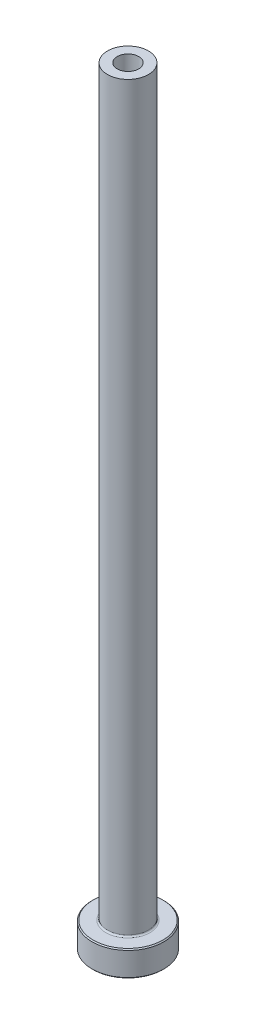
ISO-10303-21;
HEADER;
FILE_DESCRIPTION(('STEP AP214'),'2;1');
FILE_NAME('part.step','',(''),(''),'','','');
FILE_SCHEMA(('AUTOMOTIVE_DESIGN { 1 0 10303 214 1 1 1 1 }'));
ENDSEC;
DATA;
#1=APPLICATION_CONTEXT('core data for automotive mechanical design processes');
#2=APPLICATION_PROTOCOL_DEFINITION('international standard','automotive_design',2000,#1);
#3=PRODUCT_CONTEXT('',#1,'mechanical');
#4=PRODUCT('Part','Part','',(#3));
#5=PRODUCT_RELATED_PRODUCT_CATEGORY('part','',(#4));
#6=PRODUCT_DEFINITION_FORMATION('','',#4);
#7=PRODUCT_DEFINITION_CONTEXT('part definition',#1,'design');
#8=PRODUCT_DEFINITION('design','',#6,#7);
#9=PRODUCT_DEFINITION_SHAPE('','',#8);
#10=(LENGTH_UNIT() NAMED_UNIT(*) SI_UNIT(.MILLI.,.METRE.));
#11=(NAMED_UNIT(*) PLANE_ANGLE_UNIT() SI_UNIT($,.RADIAN.));
#12=(NAMED_UNIT(*) SI_UNIT($,.STERADIAN.) SOLID_ANGLE_UNIT());
#13=UNCERTAINTY_MEASURE_WITH_UNIT(LENGTH_MEASURE(1.E-05),#10,'distance_accuracy_value','');
#14=(GEOMETRIC_REPRESENTATION_CONTEXT(3) GLOBAL_UNCERTAINTY_ASSIGNED_CONTEXT((#13)) GLOBAL_UNIT_ASSIGNED_CONTEXT((#10,
#11,#12)) REPRESENTATION_CONTEXT('',''));
#15=CARTESIAN_POINT('',(0.,0.,0.));
#16=DIRECTION('',(0.,0.,1.));
#17=DIRECTION('',(1.,0.,0.));
#18=AXIS2_PLACEMENT_3D('',#15,#16,#17);
#19=CARTESIAN_POINT('',(0.,92.1876809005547,0.));
#20=DIRECTION('',(0.,1.,0.));
#21=DIRECTION('',(0.,0.,1.));
#22=AXIS2_PLACEMENT_3D('',#19,#20,#21);
#23=CYLINDRICAL_SURFACE('',#22,2.1);
#24=CARTESIAN_POINT('',(0.,150.,0.));
#25=DIRECTION('',(0.,1.,0.));
#26=DIRECTION('',(0.,0.,1.));
#27=AXIS2_PLACEMENT_3D('',#24,#25,#26);
#28=CIRCLE('',#27,2.1);
#29=CARTESIAN_POINT('',(0.,150.,2.1));
#30=VERTEX_POINT('',#29);
#31=EDGE_CURVE('E62',#30,#30,#28,.T.);
#32=ORIENTED_EDGE('',*,*,#31,.T.);
#33=EDGE_LOOP('',(#32));
#34=FACE_BOUND('',#33,.T.);
#35=CARTESIAN_POINT('',(0.,105.,0.));
#36=DIRECTION('',(0.,1.,0.));
#37=DIRECTION('',(0.,0.,1.));
#38=AXIS2_PLACEMENT_3D('',#35,#36,#37);
#39=CIRCLE('',#38,2.1);
#40=CARTESIAN_POINT('',(0.,105.,2.1));
#41=VERTEX_POINT('',#40);
#42=EDGE_CURVE('E71',#41,#41,#39,.T.);
#43=ORIENTED_EDGE('',*,*,#42,.F.);
#44=EDGE_LOOP('',(#43));
#45=FACE_BOUND('',#44,.T.);
#46=ADVANCED_FACE('F30',(#34,#45),#23,.F.);
#47=CARTESIAN_POINT('',(-2.1,150.,0.));
#48=DIRECTION('',(0.,1.,0.));
#49=DIRECTION('',(0.,0.,1.));
#50=AXIS2_PLACEMENT_3D('',#47,#48,#49);
#51=PLANE('',#50);
#52=CARTESIAN_POINT('',(0.,150.,0.));
#53=DIRECTION('',(0.,1.,0.));
#54=DIRECTION('',(0.,0.,1.));
#55=AXIS2_PLACEMENT_3D('',#52,#53,#54);
#56=CIRCLE('',#55,4.00000000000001);
#57=CARTESIAN_POINT('',(0.,150.,4.00000000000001));
#58=VERTEX_POINT('',#57);
#59=EDGE_CURVE('E65',#58,#58,#56,.T.);
#60=ORIENTED_EDGE('',*,*,#59,.T.);
#61=EDGE_LOOP('',(#60));
#62=FACE_BOUND('',#61,.T.);
#63=ORIENTED_EDGE('',*,*,#31,.F.);
#64=EDGE_LOOP('',(#63));
#65=FACE_BOUND('',#64,.T.);
#66=ADVANCED_FACE('F79',(#62,#65),#51,.T.);
#67=CARTESIAN_POINT('',(0.,92.1876809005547,0.));
#68=DIRECTION('',(0.,1.,0.));
#69=DIRECTION('',(0.,0.,1.));
#70=AXIS2_PLACEMENT_3D('',#67,#68,#69);
#71=CYLINDRICAL_SURFACE('',#70,4.);
#72=CARTESIAN_POINT('',(0.,5.3,0.));
#73=DIRECTION('',(0.,1.,0.));
#74=DIRECTION('',(0.,0.,1.));
#75=AXIS2_PLACEMENT_3D('',#72,#73,#74);
#76=CIRCLE('',#75,4.);
#77=CARTESIAN_POINT('',(0.,5.3,4.));
#78=VERTEX_POINT('',#77);
#79=EDGE_CURVE('E59',#78,#78,#76,.T.);
#80=ORIENTED_EDGE('',*,*,#79,.T.);
#81=EDGE_LOOP('',(#80));
#82=FACE_BOUND('',#81,.T.);
#83=ORIENTED_EDGE('',*,*,#59,.F.);
#84=EDGE_LOOP('',(#83));
#85=FACE_BOUND('',#84,.T.);
#86=ADVANCED_FACE('F85',(#82,#85),#71,.T.);
#87=CARTESIAN_POINT('',(-3.99999999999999,5.,0.));
#88=DIRECTION('',(0.,1.,0.));
#89=DIRECTION('',(0.,0.,1.));
#90=AXIS2_PLACEMENT_3D('',#87,#88,#89);
#91=PLANE('',#90);
#92=CARTESIAN_POINT('',(0.,5.,0.));
#93=DIRECTION('',(0.,1.,0.));
#94=DIRECTION('',(0.,0.,1.));
#95=AXIS2_PLACEMENT_3D('',#92,#93,#94);
#96=CIRCLE('',#95,6.80000000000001);
#97=CARTESIAN_POINT('',(0.,5.,6.80000000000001));
#98=VERTEX_POINT('',#97);
#99=EDGE_CURVE('E53',#98,#98,#96,.T.);
#100=ORIENTED_EDGE('',*,*,#99,.T.);
#101=EDGE_LOOP('',(#100));
#102=FACE_BOUND('',#101,.T.);
#103=CARTESIAN_POINT('',(0.,5.,0.));
#104=DIRECTION('',(0.,1.,0.));
#105=DIRECTION('',(0.,0.,1.));
#106=AXIS2_PLACEMENT_3D('',#103,#104,#105);
#107=CIRCLE('',#106,4.3);
#108=CARTESIAN_POINT('',(0.,5.,4.3));
#109=VERTEX_POINT('',#108);
#110=EDGE_CURVE('E56',#109,#109,#107,.F.);
#111=ORIENTED_EDGE('',*,*,#110,.T.);
#112=EDGE_LOOP('',(#111));
#113=FACE_BOUND('',#112,.T.);
#114=ADVANCED_FACE('F111',(#102,#113),#91,.T.);
#115=CARTESIAN_POINT('',(0.,92.1876809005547,0.));
#116=DIRECTION('',(0.,1.,0.));
#117=DIRECTION('',(0.,0.,1.));
#118=AXIS2_PLACEMENT_3D('',#115,#116,#117);
#119=CYLINDRICAL_SURFACE('',#118,6.99999999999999);
#120=CARTESIAN_POINT('',(0.,4.8,0.));
#121=DIRECTION('',(0.,1.,0.));
#122=DIRECTION('',(0.,0.,1.));
#123=AXIS2_PLACEMENT_3D('',#120,#121,#122);
#124=CIRCLE('',#123,6.99999999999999);
#125=CARTESIAN_POINT('',(0.,4.8,6.99999999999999));
#126=VERTEX_POINT('',#125);
#127=EDGE_CURVE('E45',#126,#126,#124,.F.);
#128=ORIENTED_EDGE('',*,*,#127,.T.);
#129=EDGE_LOOP('',(#128));
#130=FACE_BOUND('',#129,.T.);
#131=CARTESIAN_POINT('',(0.,0.200000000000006,0.));
#132=DIRECTION('',(0.,-1.,0.));
#133=DIRECTION('',(0.,0.,-1.));
#134=AXIS2_PLACEMENT_3D('',#131,#132,#133);
#135=CIRCLE('',#134,6.99999999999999);
#136=CARTESIAN_POINT('',(0.,0.200000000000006,-6.99999999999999));
#137=VERTEX_POINT('',#136);
#138=EDGE_CURVE('E50',#137,#137,#135,.F.);
#139=ORIENTED_EDGE('',*,*,#138,.T.);
#140=EDGE_LOOP('',(#139));
#141=FACE_BOUND('',#140,.T.);
#142=ADVANCED_FACE('F108',(#130,#141),#119,.T.);
#143=CARTESIAN_POINT('',(-6.99999999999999,0.,0.));
#144=DIRECTION('',(0.,-1.,0.));
#145=DIRECTION('',(0.,0.,-1.));
#146=AXIS2_PLACEMENT_3D('',#143,#144,#145);
#147=PLANE('',#146);
#148=CARTESIAN_POINT('',(0.,0.,0.));
#149=DIRECTION('',(0.,-1.,0.));
#150=DIRECTION('',(0.,0.,-1.));
#151=AXIS2_PLACEMENT_3D('',#148,#149,#150);
#152=CIRCLE('',#151,2.84999999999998);
#153=CARTESIAN_POINT('',(0.,0.,-2.84999999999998));
#154=VERTEX_POINT('',#153);
#155=EDGE_CURVE('E37',#154,#154,#152,.F.);
#156=ORIENTED_EDGE('',*,*,#155,.T.);
#157=EDGE_LOOP('',(#156));
#158=FACE_BOUND('',#157,.T.);
#159=CARTESIAN_POINT('',(0.,0.,0.));
#160=DIRECTION('',(0.,-1.,0.));
#161=DIRECTION('',(0.,0.,-1.));
#162=AXIS2_PLACEMENT_3D('',#159,#160,#161);
#163=CIRCLE('',#162,6.79999999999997);
#164=CARTESIAN_POINT('',(0.,0.,-6.79999999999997));
#165=VERTEX_POINT('',#164);
#166=EDGE_CURVE('E41',#165,#165,#163,.T.);
#167=ORIENTED_EDGE('',*,*,#166,.T.);
#168=EDGE_LOOP('',(#167));
#169=FACE_BOUND('',#168,.T.);
#170=ADVANCED_FACE('F110',(#158,#169),#147,.T.);
#171=CARTESIAN_POINT('',(0.,92.1876809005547,0.));
#172=DIRECTION('',(0.,1.,0.));
#173=DIRECTION('',(0.,0.,1.));
#174=AXIS2_PLACEMENT_3D('',#171,#172,#173);
#175=CYLINDRICAL_SURFACE('',#174,2.35);
#176=CARTESIAN_POINT('',(0.,0.499999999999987,0.));
#177=DIRECTION('',(0.,-1.,0.));
#178=DIRECTION('',(0.,0.,-1.));
#179=AXIS2_PLACEMENT_3D('',#176,#177,#178);
#180=CIRCLE('',#179,2.35);
#181=CARTESIAN_POINT('',(0.,0.499999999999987,-2.35));
#182=VERTEX_POINT('',#181);
#183=EDGE_CURVE('E10',#182,#182,#180,.T.);
#184=ORIENTED_EDGE('',*,*,#183,.T.);
#185=EDGE_LOOP('',(#184));
#186=FACE_BOUND('',#185,.T.);
#187=CARTESIAN_POINT('',(0.,93.,0.));
#188=DIRECTION('',(0.,1.,0.));
#189=DIRECTION('',(0.,0.,1.));
#190=AXIS2_PLACEMENT_3D('',#187,#188,#189);
#191=CIRCLE('',#190,2.35);
#192=CARTESIAN_POINT('',(0.,93.,2.35));
#193=VERTEX_POINT('',#192);
#194=EDGE_CURVE('E68',#193,#193,#191,.T.);
#195=ORIENTED_EDGE('',*,*,#194,.T.);
#196=EDGE_LOOP('',(#195));
#197=FACE_BOUND('',#196,.T.);
#198=ADVANCED_FACE('F118',(#186,#197),#175,.F.);
#199=CARTESIAN_POINT('',(0.,93.,0.));
#200=DIRECTION('',(0.,-1.,0.));
#201=DIRECTION('',(0.,0.,-1.));
#202=AXIS2_PLACEMENT_3D('',#199,#200,#201);
#203=CONICAL_SURFACE('',#202,2.35,0.0208303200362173);
#204=ORIENTED_EDGE('',*,*,#42,.T.);
#205=EDGE_LOOP('',(#204));
#206=FACE_BOUND('',#205,.T.);
#207=ORIENTED_EDGE('',*,*,#194,.F.);
#208=EDGE_LOOP('',(#207));
#209=FACE_BOUND('',#208,.T.);
#210=ADVANCED_FACE('F75',(#206,#209),#203,.F.);
#211=CARTESIAN_POINT('',(0.,5.3,0.));
#212=DIRECTION('',(0.,1.,0.));
#213=DIRECTION('',(0.,0.,1.));
#214=AXIS2_PLACEMENT_3D('',#211,#212,#213);
#215=TOROIDAL_SURFACE('',#214,4.3,0.3);
#216=ORIENTED_EDGE('',*,*,#110,.F.);
#217=EDGE_LOOP('',(#216));
#218=FACE_BOUND('',#217,.T.);
#219=ORIENTED_EDGE('',*,*,#79,.F.);
#220=EDGE_LOOP('',(#219));
#221=FACE_BOUND('',#220,.T.);
#222=ADVANCED_FACE('F90',(#218,#221),#215,.F.);
#223=CARTESIAN_POINT('',(0.,5.,0.));
#224=DIRECTION('',(0.,-1.,0.));
#225=DIRECTION('',(0.,0.,-1.));
#226=AXIS2_PLACEMENT_3D('',#223,#224,#225);
#227=CONICAL_SURFACE('',#226,6.8,0.785398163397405);
#228=ORIENTED_EDGE('',*,*,#127,.F.);
#229=EDGE_LOOP('',(#228));
#230=FACE_BOUND('',#229,.T.);
#231=ORIENTED_EDGE('',*,*,#99,.F.);
#232=EDGE_LOOP('',(#231));
#233=FACE_BOUND('',#232,.T.);
#234=ADVANCED_FACE('F93',(#230,#233),#227,.T.);
#235=CARTESIAN_POINT('',(0.,0.200000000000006,0.));
#236=DIRECTION('',(0.,1.,0.));
#237=DIRECTION('',(0.,0.,1.));
#238=AXIS2_PLACEMENT_3D('',#235,#236,#237);
#239=CONICAL_SURFACE('',#238,6.99999999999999,0.785398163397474);
#240=ORIENTED_EDGE('',*,*,#166,.F.);
#241=EDGE_LOOP('',(#240));
#242=FACE_BOUND('',#241,.T.);
#243=ORIENTED_EDGE('',*,*,#138,.F.);
#244=EDGE_LOOP('',(#243));
#245=FACE_BOUND('',#244,.T.);
#246=ADVANCED_FACE('F96',(#242,#245),#239,.T.);
#247=CARTESIAN_POINT('',(0.,0.,0.));
#248=DIRECTION('',(0.,-1.,0.));
#249=DIRECTION('',(0.,0.,-1.));
#250=AXIS2_PLACEMENT_3D('',#247,#248,#249);
#251=CONICAL_SURFACE('',#250,2.84999999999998,0.785398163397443);
#252=ORIENTED_EDGE('',*,*,#183,.F.);
#253=EDGE_LOOP('',(#252));
#254=FACE_BOUND('',#253,.T.);
#255=ORIENTED_EDGE('',*,*,#155,.F.);
#256=EDGE_LOOP('',(#255));
#257=FACE_BOUND('',#256,.T.);
#258=ADVANCED_FACE('F32',(#254,#257),#251,.F.);
#259=CLOSED_SHELL('',(#46,#66,#86,#114,#142,#170,#198,#210,#222,#234,#246,#258));
#260=MANIFOLD_SOLID_BREP('B2',#259);
#261=ADVANCED_BREP_SHAPE_REPRESENTATION('',(#18,#260),#14);
#262=SHAPE_DEFINITION_REPRESENTATION(#9,#261);
ENDSEC;
END-ISO-10303-21;
